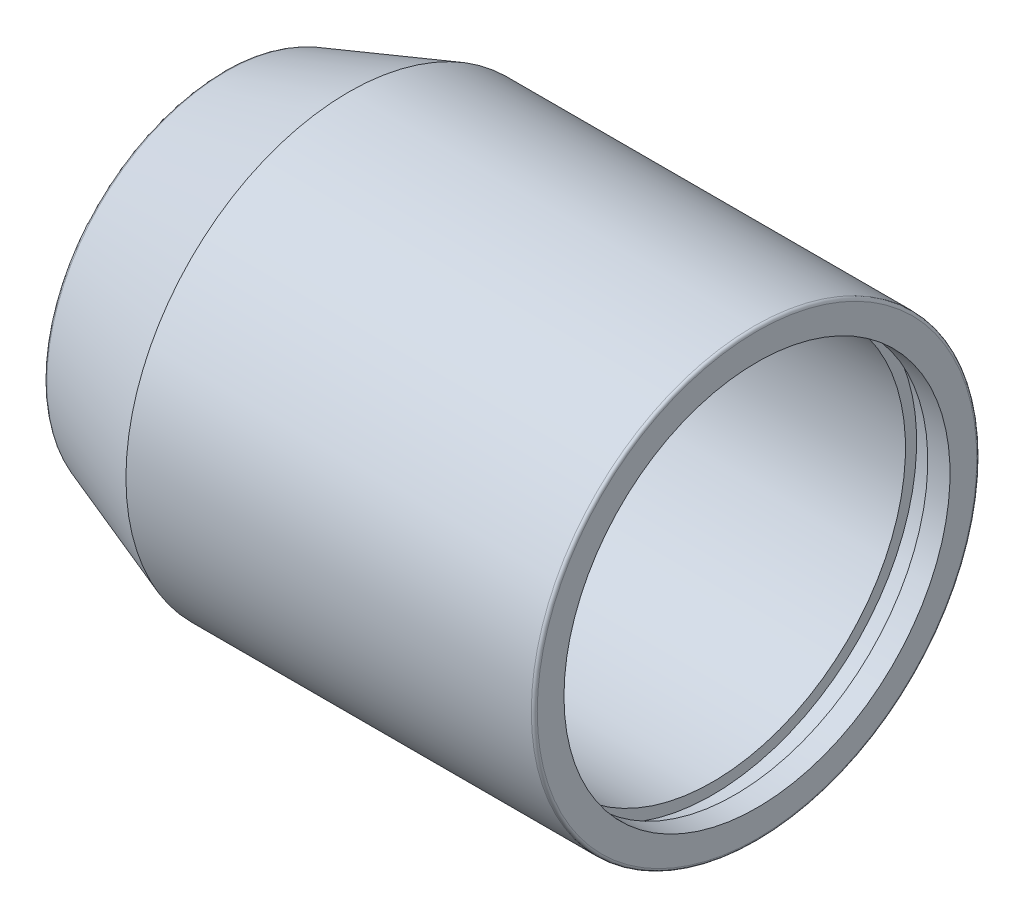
ISO-10303-21;
HEADER;
FILE_DESCRIPTION(('STEP AP214'),'2;1');
FILE_NAME('part.step','',(''),(''),'','','');
FILE_SCHEMA(('AUTOMOTIVE_DESIGN { 1 0 10303 214 1 1 1 1 }'));
ENDSEC;
DATA;
#1=APPLICATION_CONTEXT('core data for automotive mechanical design processes');
#2=APPLICATION_PROTOCOL_DEFINITION('international standard','automotive_design',2000,#1);
#3=PRODUCT_CONTEXT('',#1,'mechanical');
#4=PRODUCT('Part','Part','',(#3));
#5=PRODUCT_RELATED_PRODUCT_CATEGORY('part','',(#4));
#6=PRODUCT_DEFINITION_FORMATION('','',#4);
#7=PRODUCT_DEFINITION_CONTEXT('part definition',#1,'design');
#8=PRODUCT_DEFINITION('design','',#6,#7);
#9=PRODUCT_DEFINITION_SHAPE('','',#8);
#10=(LENGTH_UNIT() NAMED_UNIT(*) SI_UNIT(.MILLI.,.METRE.));
#11=(NAMED_UNIT(*) PLANE_ANGLE_UNIT() SI_UNIT($,.RADIAN.));
#12=(NAMED_UNIT(*) SI_UNIT($,.STERADIAN.) SOLID_ANGLE_UNIT());
#13=UNCERTAINTY_MEASURE_WITH_UNIT(LENGTH_MEASURE(1.E-05),#10,'distance_accuracy_value','');
#14=(GEOMETRIC_REPRESENTATION_CONTEXT(3) GLOBAL_UNCERTAINTY_ASSIGNED_CONTEXT((#13)) GLOBAL_UNIT_ASSIGNED_CONTEXT((#10,
#11,#12)) REPRESENTATION_CONTEXT('',''));
#15=CARTESIAN_POINT('',(0.,0.,0.));
#16=DIRECTION('',(0.,0.,1.));
#17=DIRECTION('',(1.,0.,0.));
#18=AXIS2_PLACEMENT_3D('',#15,#16,#17);
#19=CARTESIAN_POINT('',(0.,0.,0.));
#20=DIRECTION('',(1.,0.,0.));
#21=DIRECTION('',(0.,0.,-1.));
#22=AXIS2_PLACEMENT_3D('',#19,#20,#21);
#23=CONICAL_SURFACE('',#22,12.,0.339292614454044);
#24=CARTESIAN_POINT('',(0.26687195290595,0.,0.));
#25=DIRECTION('',(-1.,0.,0.));
#26=DIRECTION('',(0.,0.,1.));
#27=AXIS2_PLACEMENT_3D('',#24,#25,#26);
#28=CIRCLE('',#27,12.0941901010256);
#29=CARTESIAN_POINT('',(0.26687195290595,0.,12.0941901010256));
#30=VERTEX_POINT('',#29);
#31=EDGE_CURVE('E32',#30,#30,#28,.F.);
#32=ORIENTED_EDGE('',*,*,#31,.T.);
#33=EDGE_LOOP('',(#32));
#34=FACE_BOUND('',#33,.T.);
#35=CARTESIAN_POINT('',(8.5,0.,0.));
#36=DIRECTION('',(-1.,0.,0.));
#37=DIRECTION('',(0.,0.,1.));
#38=AXIS2_PLACEMENT_3D('',#35,#36,#37);
#39=CIRCLE('',#38,15.);
#40=CARTESIAN_POINT('',(8.5,0.,15.));
#41=VERTEX_POINT('',#40);
#42=EDGE_CURVE('E77',#41,#41,#39,.T.);
#43=ORIENTED_EDGE('',*,*,#42,.T.);
#44=EDGE_LOOP('',(#43));
#45=FACE_BOUND('',#44,.T.);
#46=ADVANCED_FACE('F22',(#34,#45),#23,.T.);
#47=CARTESIAN_POINT('',(0.,0.,9.5));
#48=DIRECTION('',(-1.,0.,0.));
#49=DIRECTION('',(0.,0.,1.));
#50=AXIS2_PLACEMENT_3D('',#47,#48,#49);
#51=PLANE('',#50);
#52=CARTESIAN_POINT('',(0.,0.,0.));
#53=DIRECTION('',(-1.,0.,0.));
#54=DIRECTION('',(0.,0.,1.));
#55=AXIS2_PLACEMENT_3D('',#52,#53,#54);
#56=CIRCLE('',#55,11.7169939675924);
#57=CARTESIAN_POINT('',(0.,0.,11.7169939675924));
#58=VERTEX_POINT('',#57);
#59=EDGE_CURVE('E36',#58,#58,#56,.T.);
#60=ORIENTED_EDGE('',*,*,#59,.T.);
#61=EDGE_LOOP('',(#60));
#62=FACE_BOUND('',#61,.T.);
#63=CARTESIAN_POINT('',(0.,0.,0.));
#64=DIRECTION('',(-1.,0.,0.));
#65=DIRECTION('',(0.,0.,1.));
#66=AXIS2_PLACEMENT_3D('',#63,#64,#65);
#67=CIRCLE('',#66,9.5);
#68=CARTESIAN_POINT('',(0.,0.,9.5));
#69=VERTEX_POINT('',#68);
#70=EDGE_CURVE('E41',#69,#69,#67,.T.);
#71=ORIENTED_EDGE('',*,*,#70,.F.);
#72=EDGE_LOOP('',(#71));
#73=FACE_BOUND('',#72,.T.);
#74=ADVANCED_FACE('F97',(#62,#73),#51,.T.);
#75=CARTESIAN_POINT('',(4.5,0.,0.));
#76=DIRECTION('',(1.,0.,0.));
#77=DIRECTION('',(0.,0.,-1.));
#78=AXIS2_PLACEMENT_3D('',#75,#76,#77);
#79=CONICAL_SURFACE('',#78,11.,0.321750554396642);
#80=ORIENTED_EDGE('',*,*,#70,.T.);
#81=EDGE_LOOP('',(#80));
#82=FACE_BOUND('',#81,.T.);
#83=CARTESIAN_POINT('',(4.5,0.,0.));
#84=DIRECTION('',(-1.,0.,0.));
#85=DIRECTION('',(0.,0.,1.));
#86=AXIS2_PLACEMENT_3D('',#83,#84,#85);
#87=CIRCLE('',#86,11.);
#88=CARTESIAN_POINT('',(4.5,0.,11.));
#89=VERTEX_POINT('',#88);
#90=EDGE_CURVE('E44',#89,#89,#87,.T.);
#91=ORIENTED_EDGE('',*,*,#90,.F.);
#92=EDGE_LOOP('',(#91));
#93=FACE_BOUND('',#92,.T.);
#94=ADVANCED_FACE('F102',(#82,#93),#79,.F.);
#95=CARTESIAN_POINT('',(6.49999999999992,0.,0.));
#96=DIRECTION('',(1.,0.,0.));
#97=DIRECTION('',(0.,0.,-1.));
#98=AXIS2_PLACEMENT_3D('',#95,#96,#97);
#99=CONICAL_SURFACE('',#98,13.,0.785398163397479);
#100=ORIENTED_EDGE('',*,*,#90,.T.);
#101=EDGE_LOOP('',(#100));
#102=FACE_BOUND('',#101,.T.);
#103=CARTESIAN_POINT('',(6.49999999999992,0.,0.));
#104=DIRECTION('',(-1.,0.,0.));
#105=DIRECTION('',(0.,0.,1.));
#106=AXIS2_PLACEMENT_3D('',#103,#104,#105);
#107=CIRCLE('',#106,13.);
#108=CARTESIAN_POINT('',(6.49999999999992,0.,13.));
#109=VERTEX_POINT('',#108);
#110=EDGE_CURVE('E47',#109,#109,#107,.T.);
#111=ORIENTED_EDGE('',*,*,#110,.F.);
#112=EDGE_LOOP('',(#111));
#113=FACE_BOUND('',#112,.T.);
#114=ADVANCED_FACE('F112',(#102,#113),#99,.F.);
#115=CARTESIAN_POINT('',(-15.5,0.,0.));
#116=DIRECTION('',(-1.,0.,0.));
#117=DIRECTION('',(0.,0.,1.));
#118=AXIS2_PLACEMENT_3D('',#115,#116,#117);
#119=CYLINDRICAL_SURFACE('',#118,13.);
#120=ORIENTED_EDGE('',*,*,#110,.T.);
#121=EDGE_LOOP('',(#120));
#122=FACE_BOUND('',#121,.T.);
#123=CARTESIAN_POINT('',(12.5,0.,0.));
#124=DIRECTION('',(-1.,0.,0.));
#125=DIRECTION('',(0.,0.,1.));
#126=AXIS2_PLACEMENT_3D('',#123,#124,#125);
#127=CIRCLE('',#126,13.);
#128=CARTESIAN_POINT('',(12.5,0.,13.));
#129=VERTEX_POINT('',#128);
#130=EDGE_CURVE('E50',#129,#129,#127,.T.);
#131=ORIENTED_EDGE('',*,*,#130,.F.);
#132=EDGE_LOOP('',(#131));
#133=FACE_BOUND('',#132,.T.);
#134=ADVANCED_FACE('F118',(#122,#133),#119,.F.);
#135=CARTESIAN_POINT('',(12.5,0.,11.5));
#136=DIRECTION('',(-1.,0.,0.));
#137=DIRECTION('',(0.,0.,1.));
#138=AXIS2_PLACEMENT_3D('',#135,#136,#137);
#139=PLANE('',#138);
#140=ORIENTED_EDGE('',*,*,#130,.T.);
#141=EDGE_LOOP('',(#140));
#142=FACE_BOUND('',#141,.T.);
#143=CARTESIAN_POINT('',(12.5,0.,0.));
#144=DIRECTION('',(-1.,0.,0.));
#145=DIRECTION('',(0.,0.,1.));
#146=AXIS2_PLACEMENT_3D('',#143,#144,#145);
#147=CIRCLE('',#146,11.5);
#148=CARTESIAN_POINT('',(12.5,0.,11.5));
#149=VERTEX_POINT('',#148);
#150=EDGE_CURVE('E53',#149,#149,#147,.T.);
#151=ORIENTED_EDGE('',*,*,#150,.F.);
#152=EDGE_LOOP('',(#151));
#153=FACE_BOUND('',#152,.T.);
#154=ADVANCED_FACE('F124',(#142,#153),#139,.T.);
#155=CARTESIAN_POINT('',(-15.5,0.,0.));
#156=DIRECTION('',(-1.,0.,0.));
#157=DIRECTION('',(0.,0.,1.));
#158=AXIS2_PLACEMENT_3D('',#155,#156,#157);
#159=CYLINDRICAL_SURFACE('',#158,11.5);
#160=ORIENTED_EDGE('',*,*,#150,.T.);
#161=EDGE_LOOP('',(#160));
#162=FACE_BOUND('',#161,.T.);
#163=CARTESIAN_POINT('',(14.,0.,0.));
#164=DIRECTION('',(-1.,0.,0.));
#165=DIRECTION('',(0.,0.,1.));
#166=AXIS2_PLACEMENT_3D('',#163,#164,#165);
#167=CIRCLE('',#166,11.5);
#168=CARTESIAN_POINT('',(14.,0.,11.5));
#169=VERTEX_POINT('',#168);
#170=EDGE_CURVE('E56',#169,#169,#167,.T.);
#171=ORIENTED_EDGE('',*,*,#170,.F.);
#172=EDGE_LOOP('',(#171));
#173=FACE_BOUND('',#172,.T.);
#174=ADVANCED_FACE('F130',(#162,#173),#159,.F.);
#175=CARTESIAN_POINT('',(14.,0.,12.9999999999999));
#176=DIRECTION('',(1.,0.,0.));
#177=DIRECTION('',(0.,0.,-1.));
#178=AXIS2_PLACEMENT_3D('',#175,#176,#177);
#179=PLANE('',#178);
#180=ORIENTED_EDGE('',*,*,#170,.T.);
#181=EDGE_LOOP('',(#180));
#182=FACE_BOUND('',#181,.T.);
#183=CARTESIAN_POINT('',(14.,0.,0.));
#184=DIRECTION('',(-1.,0.,0.));
#185=DIRECTION('',(0.,0.,1.));
#186=AXIS2_PLACEMENT_3D('',#183,#184,#185);
#187=CIRCLE('',#186,12.9999999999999);
#188=CARTESIAN_POINT('',(14.,0.,12.9999999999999));
#189=VERTEX_POINT('',#188);
#190=EDGE_CURVE('E59',#189,#189,#187,.T.);
#191=ORIENTED_EDGE('',*,*,#190,.F.);
#192=EDGE_LOOP('',(#191));
#193=FACE_BOUND('',#192,.T.);
#194=ADVANCED_FACE('F136',(#182,#193),#179,.T.);
#195=CARTESIAN_POINT('',(-15.5,0.,0.));
#196=DIRECTION('',(-1.,0.,0.));
#197=DIRECTION('',(0.,0.,1.));
#198=AXIS2_PLACEMENT_3D('',#195,#196,#197);
#199=CYLINDRICAL_SURFACE('',#198,12.9999999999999);
#200=ORIENTED_EDGE('',*,*,#190,.T.);
#201=EDGE_LOOP('',(#200));
#202=FACE_BOUND('',#201,.T.);
#203=CARTESIAN_POINT('',(33.,0.,0.));
#204=DIRECTION('',(-1.,0.,0.));
#205=DIRECTION('',(0.,0.,1.));
#206=AXIS2_PLACEMENT_3D('',#203,#204,#205);
#207=CIRCLE('',#206,12.9999999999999);
#208=CARTESIAN_POINT('',(33.,0.,12.9999999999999));
#209=VERTEX_POINT('',#208);
#210=EDGE_CURVE('E62',#209,#209,#207,.T.);
#211=ORIENTED_EDGE('',*,*,#210,.F.);
#212=EDGE_LOOP('',(#211));
#213=FACE_BOUND('',#212,.T.);
#214=ADVANCED_FACE('F142',(#202,#213),#199,.F.);
#215=CARTESIAN_POINT('',(33.,0.,13.75));
#216=DIRECTION('',(1.,0.,0.));
#217=DIRECTION('',(0.,0.,-1.));
#218=AXIS2_PLACEMENT_3D('',#215,#216,#217);
#219=PLANE('',#218);
#220=ORIENTED_EDGE('',*,*,#210,.T.);
#221=EDGE_LOOP('',(#220));
#222=FACE_BOUND('',#221,.T.);
#223=CARTESIAN_POINT('',(33.,0.,0.));
#224=DIRECTION('',(-1.,0.,0.));
#225=DIRECTION('',(0.,0.,1.));
#226=AXIS2_PLACEMENT_3D('',#223,#224,#225);
#227=CIRCLE('',#226,13.75);
#228=CARTESIAN_POINT('',(33.,0.,13.75));
#229=VERTEX_POINT('',#228);
#230=EDGE_CURVE('E65',#229,#229,#227,.T.);
#231=ORIENTED_EDGE('',*,*,#230,.F.);
#232=EDGE_LOOP('',(#231));
#233=FACE_BOUND('',#232,.T.);
#234=ADVANCED_FACE('F148',(#222,#233),#219,.T.);
#235=CARTESIAN_POINT('',(-15.5,0.,0.));
#236=DIRECTION('',(-1.,0.,0.));
#237=DIRECTION('',(0.,0.,1.));
#238=AXIS2_PLACEMENT_3D('',#235,#236,#237);
#239=CYLINDRICAL_SURFACE('',#238,13.75);
#240=ORIENTED_EDGE('',*,*,#230,.T.);
#241=EDGE_LOOP('',(#240));
#242=FACE_BOUND('',#241,.T.);
#243=CARTESIAN_POINT('',(34.5,0.,0.));
#244=DIRECTION('',(-1.,0.,0.));
#245=DIRECTION('',(0.,0.,1.));
#246=AXIS2_PLACEMENT_3D('',#243,#244,#245);
#247=CIRCLE('',#246,13.75);
#248=CARTESIAN_POINT('',(34.5,0.,13.75));
#249=VERTEX_POINT('',#248);
#250=EDGE_CURVE('E68',#249,#249,#247,.T.);
#251=ORIENTED_EDGE('',*,*,#250,.F.);
#252=EDGE_LOOP('',(#251));
#253=FACE_BOUND('',#252,.T.);
#254=ADVANCED_FACE('F154',(#242,#253),#239,.F.);
#255=CARTESIAN_POINT('',(34.5,0.,12.9999999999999));
#256=DIRECTION('',(-1.,0.,0.));
#257=DIRECTION('',(0.,0.,1.));
#258=AXIS2_PLACEMENT_3D('',#255,#256,#257);
#259=PLANE('',#258);
#260=ORIENTED_EDGE('',*,*,#250,.T.);
#261=EDGE_LOOP('',(#260));
#262=FACE_BOUND('',#261,.T.);
#263=CARTESIAN_POINT('',(34.5,0.,0.));
#264=DIRECTION('',(-1.,0.,0.));
#265=DIRECTION('',(0.,0.,1.));
#266=AXIS2_PLACEMENT_3D('',#263,#264,#265);
#267=CIRCLE('',#266,12.9999999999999);
#268=CARTESIAN_POINT('',(34.5,0.,12.9999999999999));
#269=VERTEX_POINT('',#268);
#270=EDGE_CURVE('E71',#269,#269,#267,.T.);
#271=ORIENTED_EDGE('',*,*,#270,.F.);
#272=EDGE_LOOP('',(#271));
#273=FACE_BOUND('',#272,.T.);
#274=ADVANCED_FACE('F160',(#262,#273),#259,.T.);
#275=CARTESIAN_POINT('',(-15.5,0.,0.));
#276=DIRECTION('',(-1.,0.,0.));
#277=DIRECTION('',(0.,0.,1.));
#278=AXIS2_PLACEMENT_3D('',#275,#276,#277);
#279=CYLINDRICAL_SURFACE('',#278,12.9999999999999);
#280=ORIENTED_EDGE('',*,*,#270,.T.);
#281=EDGE_LOOP('',(#280));
#282=FACE_BOUND('',#281,.T.);
#283=CARTESIAN_POINT('',(36.,0.,0.));
#284=DIRECTION('',(-1.,0.,0.));
#285=DIRECTION('',(0.,0.,1.));
#286=AXIS2_PLACEMENT_3D('',#283,#284,#285);
#287=CIRCLE('',#286,12.9999999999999);
#288=CARTESIAN_POINT('',(36.,0.,12.9999999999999));
#289=VERTEX_POINT('',#288);
#290=EDGE_CURVE('E74',#289,#289,#287,.T.);
#291=ORIENTED_EDGE('',*,*,#290,.F.);
#292=EDGE_LOOP('',(#291));
#293=FACE_BOUND('',#292,.T.);
#294=ADVANCED_FACE('F94',(#282,#293),#279,.F.);
#295=CARTESIAN_POINT('',(36.,0.,15.));
#296=DIRECTION('',(1.,0.,0.));
#297=DIRECTION('',(0.,0.,-1.));
#298=AXIS2_PLACEMENT_3D('',#295,#296,#297);
#299=PLANE('',#298);
#300=CARTESIAN_POINT('',(36.,0.,0.));
#301=DIRECTION('',(1.,0.,0.));
#302=DIRECTION('',(0.,0.,-1.));
#303=AXIS2_PLACEMENT_3D('',#300,#301,#302);
#304=CIRCLE('',#303,14.8);
#305=CARTESIAN_POINT('',(36.,0.,-14.8));
#306=VERTEX_POINT('',#305);
#307=EDGE_CURVE('E10',#306,#306,#304,.T.);
#308=ORIENTED_EDGE('',*,*,#307,.T.);
#309=EDGE_LOOP('',(#308));
#310=FACE_BOUND('',#309,.T.);
#311=ORIENTED_EDGE('',*,*,#290,.T.);
#312=EDGE_LOOP('',(#311));
#313=FACE_BOUND('',#312,.T.);
#314=ADVANCED_FACE('F85',(#310,#313),#299,.T.);
#315=CARTESIAN_POINT('',(-15.5,0.,0.));
#316=DIRECTION('',(-1.,0.,0.));
#317=DIRECTION('',(0.,0.,1.));
#318=AXIS2_PLACEMENT_3D('',#315,#316,#317);
#319=CYLINDRICAL_SURFACE('',#318,15.);
#320=CARTESIAN_POINT('',(35.8,0.,0.));
#321=DIRECTION('',(1.,0.,0.));
#322=DIRECTION('',(0.,0.,-1.));
#323=AXIS2_PLACEMENT_3D('',#320,#321,#322);
#324=CIRCLE('',#323,15.);
#325=CARTESIAN_POINT('',(35.8,0.,-15.));
#326=VERTEX_POINT('',#325);
#327=EDGE_CURVE('E28',#326,#326,#324,.F.);
#328=ORIENTED_EDGE('',*,*,#327,.T.);
#329=EDGE_LOOP('',(#328));
#330=FACE_BOUND('',#329,.T.);
#331=ORIENTED_EDGE('',*,*,#42,.F.);
#332=EDGE_LOOP('',(#331));
#333=FACE_BOUND('',#332,.T.);
#334=ADVANCED_FACE('F82',(#330,#333),#319,.T.);
#335=CARTESIAN_POINT('',(0.4,0.,0.));
#336=DIRECTION('',(-1.,0.,0.));
#337=DIRECTION('',(0.,0.,1.));
#338=AXIS2_PLACEMENT_3D('',#335,#336,#337);
#339=TOROIDAL_SURFACE('',#338,11.7169939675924,0.4);
#340=ORIENTED_EDGE('',*,*,#31,.F.);
#341=EDGE_LOOP('',(#340));
#342=FACE_BOUND('',#341,.T.);
#343=ORIENTED_EDGE('',*,*,#59,.F.);
#344=EDGE_LOOP('',(#343));
#345=FACE_BOUND('',#344,.T.);
#346=ADVANCED_FACE('F84',(#342,#345),#339,.T.);
#347=CARTESIAN_POINT('',(35.8,0.,0.));
#348=DIRECTION('',(1.,0.,0.));
#349=DIRECTION('',(0.,0.,-1.));
#350=AXIS2_PLACEMENT_3D('',#347,#348,#349);
#351=TOROIDAL_SURFACE('',#350,14.8,0.2);
#352=ORIENTED_EDGE('',*,*,#307,.F.);
#353=EDGE_LOOP('',(#352));
#354=FACE_BOUND('',#353,.T.);
#355=ORIENTED_EDGE('',*,*,#327,.F.);
#356=EDGE_LOOP('',(#355));
#357=FACE_BOUND('',#356,.T.);
#358=ADVANCED_FACE('F91',(#354,#357),#351,.T.);
#359=CLOSED_SHELL('',(#46,#74,#94,#114,#134,#154,#174,#194,#214,#234,#254,#274,#294,#314,#334,
#346,#358));
#360=MANIFOLD_SOLID_BREP('B2',#359);
#361=ADVANCED_BREP_SHAPE_REPRESENTATION('',(#18,#360),#14);
#362=SHAPE_DEFINITION_REPRESENTATION(#9,#361);
ENDSEC;
END-ISO-10303-21;
